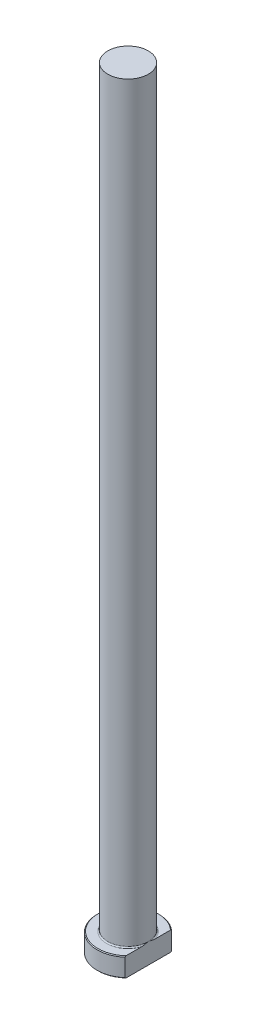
from build123d import *
from build123d.topology import SkipClean

# Parameters (mm, degrees)
CHAMFER1_SIZE = 0.2
FILLET1_R     = 0.3
KEY_DEPTH     = 201.319744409


with BuildPart() as part:
    # Sketch1 → Revolve1 (revolve)
    with BuildSketch(Plane.XY, mode=Mode.PRIVATE) as revolve1_sk:
        Polygon((0, 0), (-8, 0), (-8, 5), (-5.25, 5), (-5.25, 200), (0, 200), align=None)
    revolve(revolve1_sk.sketch.rotate(Axis((0, 259.958771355, 0), (0, -1, 0)), 270), axis=Axis((0, 259.958771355, 0), (0, -1, 0)))

    # Chamfer1
    chamfer1_edges = [part.edges().sort_by_distance(p)[0] for p in [
        (0, 5, -8),
        (0, 0, -8),
    ]]
    chamfer(chamfer1_edges, length=CHAMFER1_SIZE)

    # Fillet1
    fillet1_edges = [part.edges().sort_by_distance(p)[0] for p in [
        (0, 5, -5.25),
    ]]
    fillet(fillet1_edges, radius=FILLET1_R)

    # Sketch2 → KEY (cut, through all)
    with SkipClean():  # the faces are left unmerged after this step: merging them gives an invalid solid
        with BuildSketch(Plane(origin=(0, 0, 0), x_dir=(1, 0, 0), z_dir=(0, 1, 0))):
            with BuildLine():
                Line((5.25, 6.036348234), (5.25, -6.036348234))
                ThreePointArc((5.25, -6.036348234), (8, 0), (5.25, 6.036348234))
            make_face()
        extrude(amount=KEY_DEPTH, mode=Mode.SUBTRACT)


solid = part.part
